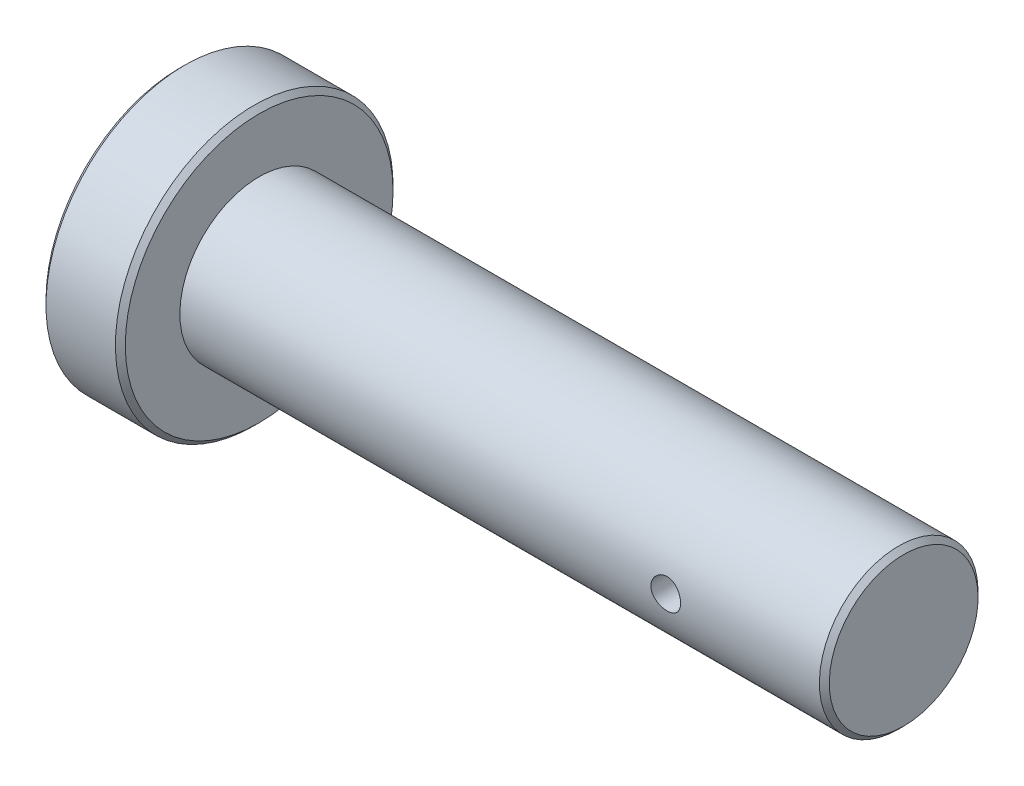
ISO-10303-21;
HEADER;
FILE_DESCRIPTION(('STEP AP214'),'2;1');
FILE_NAME('part.step','',(''),(''),'','','');
FILE_SCHEMA(('AUTOMOTIVE_DESIGN { 1 0 10303 214 1 1 1 1 }'));
ENDSEC;
DATA;
#1=APPLICATION_CONTEXT('core data for automotive mechanical design processes');
#2=APPLICATION_PROTOCOL_DEFINITION('international standard','automotive_design',2000,#1);
#3=PRODUCT_CONTEXT('',#1,'mechanical');
#4=PRODUCT('Part','Part','',(#3));
#5=PRODUCT_RELATED_PRODUCT_CATEGORY('part','',(#4));
#6=PRODUCT_DEFINITION_FORMATION('','',#4);
#7=PRODUCT_DEFINITION_CONTEXT('part definition',#1,'design');
#8=PRODUCT_DEFINITION('design','',#6,#7);
#9=PRODUCT_DEFINITION_SHAPE('','',#8);
#10=(LENGTH_UNIT() NAMED_UNIT(*) SI_UNIT(.MILLI.,.METRE.));
#11=(NAMED_UNIT(*) PLANE_ANGLE_UNIT() SI_UNIT($,.RADIAN.));
#12=(NAMED_UNIT(*) SI_UNIT($,.STERADIAN.) SOLID_ANGLE_UNIT());
#13=UNCERTAINTY_MEASURE_WITH_UNIT(LENGTH_MEASURE(1.E-05),#10,'distance_accuracy_value','');
#14=(GEOMETRIC_REPRESENTATION_CONTEXT(3) GLOBAL_UNCERTAINTY_ASSIGNED_CONTEXT((#13)) GLOBAL_UNIT_ASSIGNED_CONTEXT((#10,
#11,#12)) REPRESENTATION_CONTEXT('',''));
#15=CARTESIAN_POINT('',(0.,0.,0.));
#16=DIRECTION('',(0.,0.,1.));
#17=DIRECTION('',(1.,0.,0.));
#18=AXIS2_PLACEMENT_3D('',#15,#16,#17);
#19=CARTESIAN_POINT('',(17.0769362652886,1.17620270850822E-07,0.));
#20=DIRECTION('',(1.,0.,0.));
#21=DIRECTION('',(0.,1.,0.));
#22=AXIS2_PLACEMENT_3D('',#19,#20,#21);
#23=PLANE('',#22);
#24=CARTESIAN_POINT('',(17.0769362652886,1.17620270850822E-07,0.));
#25=DIRECTION('',(1.,0.,0.));
#26=DIRECTION('',(0.,1.,0.));
#27=AXIS2_PLACEMENT_3D('',#24,#25,#26);
#28=CIRCLE('',#27,5.90625000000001);
#29=CARTESIAN_POINT('',(17.0769362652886,5.90625011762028,0.));
#30=VERTEX_POINT('',#29);
#31=EDGE_CURVE('E11',#30,#30,#28,.F.);
#32=ORIENTED_EDGE('',*,*,#31,.T.);
#33=EDGE_LOOP('',(#32));
#34=FACE_BOUND('',#33,.T.);
#35=ADVANCED_FACE('F52',(#34),#23,.F.);
#36=CARTESIAN_POINT('',(17.0769362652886,1.17620270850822E-07,0.));
#37=DIRECTION('',(-1.,0.,0.));
#38=DIRECTION('',(0.,-1.,0.));
#39=AXIS2_PLACEMENT_3D('',#36,#37,#38);
#40=CYLINDRICAL_SURFACE('',#39,6.125);
#41=CARTESIAN_POINT('',(20.3581862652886,1.17620271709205E-07,0.));
#42=DIRECTION('',(-1.,0.,0.));
#43=DIRECTION('',(0.,-1.,0.));
#44=AXIS2_PLACEMENT_3D('',#41,#42,#43);
#45=CIRCLE('',#44,6.125);
#46=CARTESIAN_POINT('',(20.3581862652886,-6.12499988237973,0.));
#47=VERTEX_POINT('',#46);
#48=EDGE_CURVE('E63',#47,#47,#45,.T.);
#49=ORIENTED_EDGE('',*,*,#48,.T.);
#50=EDGE_LOOP('',(#49));
#51=FACE_BOUND('',#50,.T.);
#52=CARTESIAN_POINT('',(17.2956862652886,1.17620270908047E-07,0.));
#53=DIRECTION('',(1.,0.,0.));
#54=DIRECTION('',(0.,1.,0.));
#55=AXIS2_PLACEMENT_3D('',#52,#53,#54);
#56=CIRCLE('',#55,6.125);
#57=CARTESIAN_POINT('',(17.2956862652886,6.12500011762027,0.));
#58=VERTEX_POINT('',#57);
#59=EDGE_CURVE('E67',#58,#58,#56,.T.);
#60=ORIENTED_EDGE('',*,*,#59,.T.);
#61=EDGE_LOOP('',(#60));
#62=FACE_BOUND('',#61,.T.);
#63=ADVANCED_FACE('F111',(#51,#62),#40,.T.);
#64=CARTESIAN_POINT('',(20.5769362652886,6.12500011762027,0.));
#65=DIRECTION('',(-1.,0.,0.));
#66=DIRECTION('',(0.,-1.,0.));
#67=AXIS2_PLACEMENT_3D('',#64,#65,#66);
#68=PLANE('',#67);
#69=CARTESIAN_POINT('',(20.5769362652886,1.17620271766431E-07,0.));
#70=DIRECTION('',(-1.,0.,0.));
#71=DIRECTION('',(0.,-1.,0.));
#72=AXIS2_PLACEMENT_3D('',#69,#70,#71);
#73=CIRCLE('',#72,5.90625);
#74=CARTESIAN_POINT('',(20.5769362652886,-5.90624988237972,0.));
#75=VERTEX_POINT('',#74);
#76=EDGE_CURVE('E59',#75,#75,#73,.F.);
#77=ORIENTED_EDGE('',*,*,#76,.T.);
#78=EDGE_LOOP('',(#77));
#79=FACE_BOUND('',#78,.T.);
#80=CARTESIAN_POINT('',(20.5769362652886,1.17620271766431E-07,0.));
#81=DIRECTION('',(-1.,0.,0.));
#82=DIRECTION('',(0.,-1.,0.));
#83=AXIS2_PLACEMENT_3D('',#80,#81,#82);
#84=CIRCLE('',#83,3.5);
#85=CARTESIAN_POINT('',(20.5769362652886,-3.49999988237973,0.));
#86=VERTEX_POINT('',#85);
#87=EDGE_CURVE('E78',#86,#86,#84,.T.);
#88=ORIENTED_EDGE('',*,*,#87,.T.);
#89=EDGE_LOOP('',(#88));
#90=FACE_BOUND('',#89,.T.);
#91=ADVANCED_FACE('F108',(#79,#90),#68,.F.);
#92=CARTESIAN_POINT('',(17.0769362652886,1.17620270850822E-07,0.));
#93=DIRECTION('',(-1.,0.,0.));
#94=DIRECTION('',(0.,-1.,0.));
#95=AXIS2_PLACEMENT_3D('',#92,#93,#94);
#96=CYLINDRICAL_SURFACE('',#95,3.5);
#97=CARTESIAN_POINT('',(48.7956862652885,1.17620279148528E-07,0.));
#98=DIRECTION('',(-1.,0.,0.));
#99=DIRECTION('',(0.,-1.,0.));
#100=AXIS2_PLACEMENT_3D('',#97,#98,#99);
#101=CIRCLE('',#100,3.5);
#102=CARTESIAN_POINT('',(48.7956862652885,-3.49999988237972,0.));
#103=VERTEX_POINT('',#102);
#104=EDGE_CURVE('E75',#103,#103,#101,.T.);
#105=ORIENTED_EDGE('',*,*,#104,.T.);
#106=EDGE_LOOP('',(#105));
#107=FACE_BOUND('',#106,.T.);
#108=CARTESIAN_POINT('',(42.6706862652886,1.17620270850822E-07,-3.5));
#109=CARTESIAN_POINT('',(42.6706848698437,0.0365190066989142,-3.4999993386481));
#110=CARTESIAN_POINT('',(42.6676276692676,0.0730560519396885,-3.4994225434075));
#111=CARTESIAN_POINT('',(42.6554875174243,0.145100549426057,-3.49717718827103));
#112=CARTESIAN_POINT('',(42.6463994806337,0.18060710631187,-3.49550770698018));
#113=CARTESIAN_POINT('',(42.6224857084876,0.249538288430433,-3.49126373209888));
#114=CARTESIAN_POINT('',(42.6076651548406,0.282964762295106,-3.48869005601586));
#115=CARTESIAN_POINT('',(42.5727217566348,0.346853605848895,-3.48291873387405));
#116=CARTESIAN_POINT('',(42.5525993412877,0.377316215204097,-3.47972113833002));
#117=CARTESIAN_POINT('',(42.507367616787,0.434780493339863,-3.47301209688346));
#118=CARTESIAN_POINT('',(42.4822071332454,0.461741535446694,-3.46949765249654));
#119=CARTESIAN_POINT('',(42.4277235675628,0.511085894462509,-3.4625732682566));
#120=CARTESIAN_POINT('',(42.3984001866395,0.5334688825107,-3.45916333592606));
#121=CARTESIAN_POINT('',(42.3361361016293,0.573190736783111,-3.4528049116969));
#122=CARTESIAN_POINT('',(42.3031686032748,0.59048827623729,-3.44986028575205));
#123=CARTESIAN_POINT('',(42.2347311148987,0.619283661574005,-3.44480812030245));
#124=CARTESIAN_POINT('',(42.1992613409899,0.630782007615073,-3.44270050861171));
#125=CARTESIAN_POINT('',(42.1272608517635,0.647522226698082,-3.43959117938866));
#126=CARTESIAN_POINT('',(42.0907471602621,0.65283494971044,-3.43857694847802));
#127=CARTESIAN_POINT('',(42.017333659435,0.657273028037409,-3.43773148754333));
#128=CARTESIAN_POINT('',(41.9804338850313,0.65639893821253,-3.43790015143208));
#129=CARTESIAN_POINT('',(41.9078089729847,0.648545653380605,-3.43939003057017));
#130=CARTESIAN_POINT('',(41.8720747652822,0.641647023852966,-3.44069603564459));
#131=CARTESIAN_POINT('',(41.8022800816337,0.622067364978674,-3.44428955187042));
#132=CARTESIAN_POINT('',(41.7682196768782,0.609386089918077,-3.44657710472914));
#133=CARTESIAN_POINT('',(41.702503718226,0.578522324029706,-3.45189186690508));
#134=CARTESIAN_POINT('',(41.6708638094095,0.560307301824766,-3.45492342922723));
#135=CARTESIAN_POINT('',(41.6110591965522,0.518916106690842,-3.46138175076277));
#136=CARTESIAN_POINT('',(41.5828948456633,0.495739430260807,-3.46480855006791));
#137=CARTESIAN_POINT('',(41.5303753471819,0.444648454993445,-3.47173750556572));
#138=CARTESIAN_POINT('',(41.5060872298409,0.416665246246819,-3.47523999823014));
#139=CARTESIAN_POINT('',(41.4625399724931,0.356986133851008,-3.48187606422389));
#140=CARTESIAN_POINT('',(41.4432808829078,0.325290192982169,-3.4850096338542));
#141=CARTESIAN_POINT('',(41.4103284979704,0.259015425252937,-3.4905611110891));
#142=CARTESIAN_POINT('',(41.3966421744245,0.224433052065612,-3.49297812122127));
#143=CARTESIAN_POINT('',(41.3752915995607,0.153404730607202,-3.4968172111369));
#144=CARTESIAN_POINT('',(41.3676267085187,0.116958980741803,-3.49823939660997));
#145=CARTESIAN_POINT('',(41.3586298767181,0.0438151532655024,-3.49991407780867));
#146=CARTESIAN_POINT('',(41.3572060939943,0.0071287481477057,-3.50018353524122));
#147=CARTESIAN_POINT('',(41.3604855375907,-0.0659579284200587,-3.49956925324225));
#148=CARTESIAN_POINT('',(41.3651884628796,-0.102358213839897,-3.49868557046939));
#149=CARTESIAN_POINT('',(41.3805114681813,-0.173548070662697,-3.49587486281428));
#150=CARTESIAN_POINT('',(41.3910850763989,-0.208347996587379,-3.49395603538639));
#151=CARTESIAN_POINT('',(41.4177990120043,-0.275681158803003,-3.48928930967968));
#152=CARTESIAN_POINT('',(41.4339397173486,-0.308214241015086,-3.48654135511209));
#153=CARTESIAN_POINT('',(41.4715329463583,-0.370482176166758,-3.48047888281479));
#154=CARTESIAN_POINT('',(41.4930415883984,-0.400182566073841,-3.47715850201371));
#155=CARTESIAN_POINT('',(41.5406842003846,-0.455585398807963,-3.47033462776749));
#156=CARTESIAN_POINT('',(41.5668186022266,-0.481287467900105,-3.46683111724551));
#157=CARTESIAN_POINT('',(41.6233866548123,-0.528313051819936,-3.45997958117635));
#158=CARTESIAN_POINT('',(41.6538727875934,-0.549573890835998,-3.45663423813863));
#159=CARTESIAN_POINT('',(41.7180377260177,-0.586672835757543,-3.45053181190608));
#160=CARTESIAN_POINT('',(41.7517164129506,-0.602511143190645,-3.44777470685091));
#161=CARTESIAN_POINT('',(41.8211513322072,-0.628226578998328,-3.44318198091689));
#162=CARTESIAN_POINT('',(41.8568966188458,-0.638132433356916,-3.44134192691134));
#163=CARTESIAN_POINT('',(41.9295819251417,-0.651790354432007,-3.43878151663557));
#164=CARTESIAN_POINT('',(41.9665218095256,-0.655543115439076,-3.43806103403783));
#165=CARTESIAN_POINT('',(42.0399199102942,-0.656765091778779,-3.43782774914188));
#166=CARTESIAN_POINT('',(42.0763764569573,-0.654333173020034,-3.43829594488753));
#167=CARTESIAN_POINT('',(42.1483512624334,-0.64347127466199,-3.44034512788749));
#168=CARTESIAN_POINT('',(42.1838695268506,-0.635041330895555,-3.44192610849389));
#169=CARTESIAN_POINT('',(42.2529063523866,-0.612464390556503,-3.44601472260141));
#170=CARTESIAN_POINT('',(42.2864285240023,-0.598328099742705,-3.44852062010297));
#171=CARTESIAN_POINT('',(42.3506411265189,-0.564750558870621,-3.4541779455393));
#172=CARTESIAN_POINT('',(42.3813313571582,-0.545308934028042,-3.45732941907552));
#173=CARTESIAN_POINT('',(42.4395041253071,-0.501328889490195,-3.46398178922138));
#174=CARTESIAN_POINT('',(42.4669317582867,-0.476718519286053,-3.46748721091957));
#175=CARTESIAN_POINT('',(42.5173010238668,-0.423249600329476,-3.47441864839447));
#176=CARTESIAN_POINT('',(42.5402416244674,-0.394390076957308,-3.47784464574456));
#177=CARTESIAN_POINT('',(42.5811785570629,-0.332930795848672,-3.48426739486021));
#178=CARTESIAN_POINT('',(42.5991285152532,-0.300299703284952,-3.4872600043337));
#179=CARTESIAN_POINT('',(42.6292627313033,-0.232439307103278,-3.49243833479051));
#180=CARTESIAN_POINT('',(42.6414524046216,-0.197212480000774,-3.49462481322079));
#181=CARTESIAN_POINT('',(42.6572450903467,-0.134901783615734,-3.49749877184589));
#182=CARTESIAN_POINT('',(42.6622769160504,-0.108182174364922,-3.49843143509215));
#183=CARTESIAN_POINT('',(42.6689979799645,-0.0543116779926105,-3.4996822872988));
#184=CARTESIAN_POINT('',(42.6706873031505,-0.0271608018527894,-3.5000004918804));
#185=CARTESIAN_POINT('',(42.6706862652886,1.17620270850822E-07,-3.5));
#186=B_SPLINE_CURVE_WITH_KNOTS('',3,(#108,#109,#110,#111,#112,#113,#114,#115,#116,#117,#118,
#119,#120,#121,#122,#123,#124,#125,#126,#127,#128,#129,#130,#131,#132,#133,#134,#135,#136,#137,
#138,#139,#140,#141,#142,#143,#144,#145,#146,#147,#148,#149,#150,#151,#152,#153,#154,#155,#156,
#157,#158,#159,#160,#161,#162,#163,#164,#165,#166,#167,#168,#169,#170,#171,#172,#173,#174,#175,
#176,#177,#178,#179,#180,#181,#182,#183,#184,#185),.UNSPECIFIED.,.T.,.F.,(4,2,2,2,2,2,2,2,2,2,2,
2,2,2,2,2,2,2,2,2,2,2,2,2,2,2,2,2,2,2,2,2,2,2,2,2,2,2,4),(0.,0.109457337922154,
0.219007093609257,0.328458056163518,0.437900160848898,0.548516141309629,0.659140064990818,
0.770639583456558,0.882129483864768,0.99232941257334,1.10251945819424,1.21125812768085,
1.32000141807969,1.42939677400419,1.53880323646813,1.64993398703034,1.76106585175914,
1.87233632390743,1.98359497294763,2.09321076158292,2.20282116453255,2.31157602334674,
2.42033826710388,2.53028902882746,2.6402500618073,2.75167128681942,2.86308837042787,
2.97396149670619,3.084822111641,3.19392172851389,3.30302069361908,3.41191592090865,
3.52081884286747,3.63135224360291,3.74191103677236,3.85346521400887,3.96491430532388,
4.04632525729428,4.12773413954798),.UNSPECIFIED.);
#187=CARTESIAN_POINT('',(42.6706862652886,1.17620270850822E-07,-3.5));
#188=VERTEX_POINT('',#187);
#189=EDGE_CURVE('E79',#188,#188,#186,.T.);
#190=ORIENTED_EDGE('',*,*,#189,.T.);
#191=EDGE_LOOP('',(#190));
#192=FACE_BOUND('',#191,.T.);
#193=CARTESIAN_POINT('',(42.6706862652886,1.17620270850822E-07,3.5));
#194=CARTESIAN_POINT('',(42.6706848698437,-0.0365187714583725,3.4999993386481));
#195=CARTESIAN_POINT('',(42.6676276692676,-0.0730558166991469,3.4994225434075));
#196=CARTESIAN_POINT('',(42.6554875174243,-0.145100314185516,3.49717718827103));
#197=CARTESIAN_POINT('',(42.6463994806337,-0.180606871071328,3.49550770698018));
#198=CARTESIAN_POINT('',(42.6224857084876,-0.249538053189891,3.49126373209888));
#199=CARTESIAN_POINT('',(42.6076651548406,-0.282964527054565,3.48869005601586));
#200=CARTESIAN_POINT('',(42.5727217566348,-0.346853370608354,3.48291873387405));
#201=CARTESIAN_POINT('',(42.5525993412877,-0.377315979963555,3.47972113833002));
#202=CARTESIAN_POINT('',(42.507367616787,-0.434780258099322,3.47301209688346));
#203=CARTESIAN_POINT('',(42.4822071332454,-0.461741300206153,3.46949765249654));
#204=CARTESIAN_POINT('',(42.4277235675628,-0.511085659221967,3.4625732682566));
#205=CARTESIAN_POINT('',(42.3984001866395,-0.533468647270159,3.45916333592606));
#206=CARTESIAN_POINT('',(42.3361361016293,-0.57319050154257,3.4528049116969));
#207=CARTESIAN_POINT('',(42.3031686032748,-0.590488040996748,3.44986028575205));
#208=CARTESIAN_POINT('',(42.2347311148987,-0.619283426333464,3.44480812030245));
#209=CARTESIAN_POINT('',(42.1992613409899,-0.630781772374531,3.44270050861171));
#210=CARTESIAN_POINT('',(42.1272608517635,-0.64752199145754,3.43959117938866));
#211=CARTESIAN_POINT('',(42.0907471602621,-0.652834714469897,3.43857694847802));
#212=CARTESIAN_POINT('',(42.017333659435,-0.657272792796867,3.43773148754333));
#213=CARTESIAN_POINT('',(41.9804338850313,-0.656398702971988,3.43790015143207));
#214=CARTESIAN_POINT('',(41.9078089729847,-0.648545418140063,3.43939003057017));
#215=CARTESIAN_POINT('',(41.8720747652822,-0.641646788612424,3.44069603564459));
#216=CARTESIAN_POINT('',(41.8022800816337,-0.622067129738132,3.44428955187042));
#217=CARTESIAN_POINT('',(41.7682196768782,-0.609385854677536,3.44657710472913));
#218=CARTESIAN_POINT('',(41.702503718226,-0.578522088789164,3.45189186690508));
#219=CARTESIAN_POINT('',(41.6708638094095,-0.560307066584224,3.45492342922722));
#220=CARTESIAN_POINT('',(41.6110591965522,-0.5189158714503,3.46138175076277));
#221=CARTESIAN_POINT('',(41.5828948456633,-0.495739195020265,3.46480855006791));
#222=CARTESIAN_POINT('',(41.5303753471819,-0.444648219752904,3.47173750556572));
#223=CARTESIAN_POINT('',(41.5060872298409,-0.416665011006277,3.47523999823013));
#224=CARTESIAN_POINT('',(41.4625399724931,-0.356985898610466,3.48187606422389));
#225=CARTESIAN_POINT('',(41.4432808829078,-0.325289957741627,3.4850096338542));
#226=CARTESIAN_POINT('',(41.4103284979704,-0.259015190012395,3.4905611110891));
#227=CARTESIAN_POINT('',(41.3966421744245,-0.22443281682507,3.49297812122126));
#228=CARTESIAN_POINT('',(41.3752915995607,-0.15340449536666,3.4968172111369));
#229=CARTESIAN_POINT('',(41.3676267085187,-0.116958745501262,3.49823939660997));
#230=CARTESIAN_POINT('',(41.3586298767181,-0.0438149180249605,3.49991407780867));
#231=CARTESIAN_POINT('',(41.3572060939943,-0.00712851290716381,3.50018353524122));
#232=CARTESIAN_POINT('',(41.3604855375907,0.0659581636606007,3.49956925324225));
#233=CARTESIAN_POINT('',(41.3651884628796,0.102358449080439,3.49868557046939));
#234=CARTESIAN_POINT('',(41.3805114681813,0.173548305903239,3.49587486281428));
#235=CARTESIAN_POINT('',(41.3910850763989,0.208348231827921,3.49395603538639));
#236=CARTESIAN_POINT('',(41.4177990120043,0.275681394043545,3.48928930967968));
#237=CARTESIAN_POINT('',(41.4339397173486,0.308214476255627,3.48654135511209));
#238=CARTESIAN_POINT('',(41.4715329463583,0.3704824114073,3.48047888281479));
#239=CARTESIAN_POINT('',(41.4930415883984,0.400182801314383,3.47715850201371));
#240=CARTESIAN_POINT('',(41.5406842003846,0.455585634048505,3.47033462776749));
#241=CARTESIAN_POINT('',(41.5668186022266,0.481287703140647,3.46683111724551));
#242=CARTESIAN_POINT('',(41.6233866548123,0.528313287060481,3.45997958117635));
#243=CARTESIAN_POINT('',(41.6538727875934,0.549574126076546,3.45663423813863));
#244=CARTESIAN_POINT('',(41.7180377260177,0.58667307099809,3.45053181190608));
#245=CARTESIAN_POINT('',(41.7517164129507,0.602511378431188,3.44777470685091));
#246=CARTESIAN_POINT('',(41.8211513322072,0.628226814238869,3.44318198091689));
#247=CARTESIAN_POINT('',(41.8568966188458,0.63813266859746,3.44134192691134));
#248=CARTESIAN_POINT('',(41.9295819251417,0.651790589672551,3.43878151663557));
#249=CARTESIAN_POINT('',(41.9665218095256,0.655543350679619,3.43806103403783));
#250=CARTESIAN_POINT('',(42.0399199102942,0.65676532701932,3.43782774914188));
#251=CARTESIAN_POINT('',(42.0763764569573,0.654333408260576,3.43829594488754));
#252=CARTESIAN_POINT('',(42.1483512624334,0.643471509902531,3.4403451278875));
#253=CARTESIAN_POINT('',(42.1838695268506,0.635041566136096,3.44192610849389));
#254=CARTESIAN_POINT('',(42.2529063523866,0.612464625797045,3.44601472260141));
#255=CARTESIAN_POINT('',(42.2864285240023,0.598328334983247,3.44852062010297));
#256=CARTESIAN_POINT('',(42.3506411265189,0.564750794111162,3.4541779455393));
#257=CARTESIAN_POINT('',(42.3813313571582,0.545309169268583,3.45732941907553));
#258=CARTESIAN_POINT('',(42.4395041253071,0.501329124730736,3.46398178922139));
#259=CARTESIAN_POINT('',(42.4669317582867,0.476718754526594,3.46748721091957));
#260=CARTESIAN_POINT('',(42.5173010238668,0.423249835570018,3.47441864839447));
#261=CARTESIAN_POINT('',(42.5402416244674,0.39439031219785,3.47784464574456));
#262=CARTESIAN_POINT('',(42.5811785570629,0.332931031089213,3.48426739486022));
#263=CARTESIAN_POINT('',(42.5991285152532,0.300299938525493,3.48726000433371));
#264=CARTESIAN_POINT('',(42.6292627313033,0.23243954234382,3.49243833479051));
#265=CARTESIAN_POINT('',(42.6414524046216,0.197212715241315,3.49462481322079));
#266=CARTESIAN_POINT('',(42.6572450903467,0.134902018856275,3.49749877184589));
#267=CARTESIAN_POINT('',(42.6622769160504,0.108182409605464,3.49843143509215));
#268=CARTESIAN_POINT('',(42.6689979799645,0.054311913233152,3.4996822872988));
#269=CARTESIAN_POINT('',(42.6706873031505,0.027161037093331,3.5000004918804));
#270=CARTESIAN_POINT('',(42.6706862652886,1.17620270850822E-07,3.5));
#271=B_SPLINE_CURVE_WITH_KNOTS('',3,(#193,#194,#195,#196,#197,#198,#199,#200,#201,#202,#203,
#204,#205,#206,#207,#208,#209,#210,#211,#212,#213,#214,#215,#216,#217,#218,#219,#220,#221,#222,
#223,#224,#225,#226,#227,#228,#229,#230,#231,#232,#233,#234,#235,#236,#237,#238,#239,#240,#241,
#242,#243,#244,#245,#246,#247,#248,#249,#250,#251,#252,#253,#254,#255,#256,#257,#258,#259,#260,
#261,#262,#263,#264,#265,#266,#267,#268,#269,#270),.UNSPECIFIED.,.T.,.F.,(4,2,2,2,2,2,2,2,2,2,2,
2,2,2,2,2,2,2,2,2,2,2,2,2,2,2,2,2,2,2,2,2,2,2,2,2,2,2,4),(0.,0.109457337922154,
0.219007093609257,0.328458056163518,0.437900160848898,0.548516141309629,0.659140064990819,
0.770639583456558,0.882129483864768,0.992329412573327,1.10251945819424,1.21125812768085,
1.32000141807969,1.42939677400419,1.53880323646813,1.64993398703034,1.76106585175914,
1.87233632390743,1.98359497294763,2.09321076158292,2.20282116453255,2.31157602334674,
2.42033826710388,2.53028902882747,2.6402500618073,2.75167128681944,2.86308837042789,
2.9739614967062,3.084822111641,3.19392172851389,3.30302069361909,3.41191592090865,
3.52081884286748,3.63135224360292,3.74191103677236,3.85346521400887,3.96491430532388,
4.04632525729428,4.12773413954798),.UNSPECIFIED.);
#272=CARTESIAN_POINT('',(42.6706862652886,1.17620270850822E-07,3.5));
#273=VERTEX_POINT('',#272);
#274=EDGE_CURVE('E87',#273,#273,#271,.T.);
#275=ORIENTED_EDGE('',*,*,#274,.T.);
#276=EDGE_LOOP('',(#275));
#277=FACE_BOUND('',#276,.T.);
#278=ORIENTED_EDGE('',*,*,#87,.F.);
#279=EDGE_LOOP('',(#278));
#280=FACE_BOUND('',#279,.T.);
#281=ADVANCED_FACE('F92',(#107,#192,#277,#280),#96,.T.);
#282=CARTESIAN_POINT('',(49.0144362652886,3.50000011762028,0.));
#283=DIRECTION('',(-1.,0.,0.));
#284=DIRECTION('',(0.,-1.,0.));
#285=AXIS2_PLACEMENT_3D('',#282,#283,#284);
#286=PLANE('',#285);
#287=CARTESIAN_POINT('',(49.0144362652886,1.17620279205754E-07,0.));
#288=DIRECTION('',(-1.,0.,0.));
#289=DIRECTION('',(0.,-1.,0.));
#290=AXIS2_PLACEMENT_3D('',#287,#288,#289);
#291=CIRCLE('',#290,3.28124999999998);
#292=CARTESIAN_POINT('',(49.0144362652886,-3.2812498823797,0.));
#293=VERTEX_POINT('',#292);
#294=EDGE_CURVE('E72',#293,#293,#291,.F.);
#295=ORIENTED_EDGE('',*,*,#294,.T.);
#296=EDGE_LOOP('',(#295));
#297=FACE_BOUND('',#296,.T.);
#298=ADVANCED_FACE('F100',(#297),#286,.F.);
#299=CARTESIAN_POINT('',(42.0144362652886,1.17620270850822E-07,-8.75));
#300=DIRECTION('',(0.,0.,1.));
#301=DIRECTION('',(1.,0.,0.));
#302=AXIS2_PLACEMENT_3D('',#299,#300,#301);
#303=CYLINDRICAL_SURFACE('',#302,0.656249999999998);
#304=ORIENTED_EDGE('',*,*,#274,.F.);
#305=EDGE_LOOP('',(#304));
#306=FACE_BOUND('',#305,.T.);
#307=ORIENTED_EDGE('',*,*,#189,.F.);
#308=EDGE_LOOP('',(#307));
#309=FACE_BOUND('',#308,.T.);
#310=ADVANCED_FACE('F96',(#306,#309),#303,.F.);
#311=CARTESIAN_POINT('',(48.7956862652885,1.17620279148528E-07,0.));
#312=DIRECTION('',(-1.,0.,0.));
#313=DIRECTION('',(0.,-1.,0.));
#314=AXIS2_PLACEMENT_3D('',#311,#312,#313);
#315=CONICAL_SURFACE('',#314,3.5,0.785398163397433);
#316=ORIENTED_EDGE('',*,*,#294,.F.);
#317=EDGE_LOOP('',(#316));
#318=FACE_BOUND('',#317,.T.);
#319=ORIENTED_EDGE('',*,*,#104,.F.);
#320=EDGE_LOOP('',(#319));
#321=FACE_BOUND('',#320,.T.);
#322=ADVANCED_FACE('F99',(#318,#321),#315,.T.);
#323=CARTESIAN_POINT('',(20.3581862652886,1.17620271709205E-07,0.));
#324=DIRECTION('',(-1.,0.,0.));
#325=DIRECTION('',(0.,-1.,0.));
#326=AXIS2_PLACEMENT_3D('',#323,#324,#325);
#327=CONICAL_SURFACE('',#326,6.125,0.785398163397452);
#328=ORIENTED_EDGE('',*,*,#76,.F.);
#329=EDGE_LOOP('',(#328));
#330=FACE_BOUND('',#329,.T.);
#331=ORIENTED_EDGE('',*,*,#48,.F.);
#332=EDGE_LOOP('',(#331));
#333=FACE_BOUND('',#332,.T.);
#334=ADVANCED_FACE('F120',(#330,#333),#327,.T.);
#335=CARTESIAN_POINT('',(17.0769362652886,1.17620270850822E-07,0.));
#336=DIRECTION('',(1.,0.,0.));
#337=DIRECTION('',(0.,1.,0.));
#338=AXIS2_PLACEMENT_3D('',#335,#336,#337);
#339=CONICAL_SURFACE('',#338,5.90625000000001,0.785398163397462);
#340=ORIENTED_EDGE('',*,*,#59,.F.);
#341=EDGE_LOOP('',(#340));
#342=FACE_BOUND('',#341,.T.);
#343=ORIENTED_EDGE('',*,*,#31,.F.);
#344=EDGE_LOOP('',(#343));
#345=FACE_BOUND('',#344,.T.);
#346=ADVANCED_FACE('F54',(#342,#345),#339,.T.);
#347=CLOSED_SHELL('',(#35,#63,#91,#281,#298,#310,#322,#334,#346));
#348=MANIFOLD_SOLID_BREP('B2',#347);
#349=ADVANCED_BREP_SHAPE_REPRESENTATION('',(#18,#348),#14);
#350=SHAPE_DEFINITION_REPRESENTATION(#9,#349);
ENDSEC;
END-ISO-10303-21;
